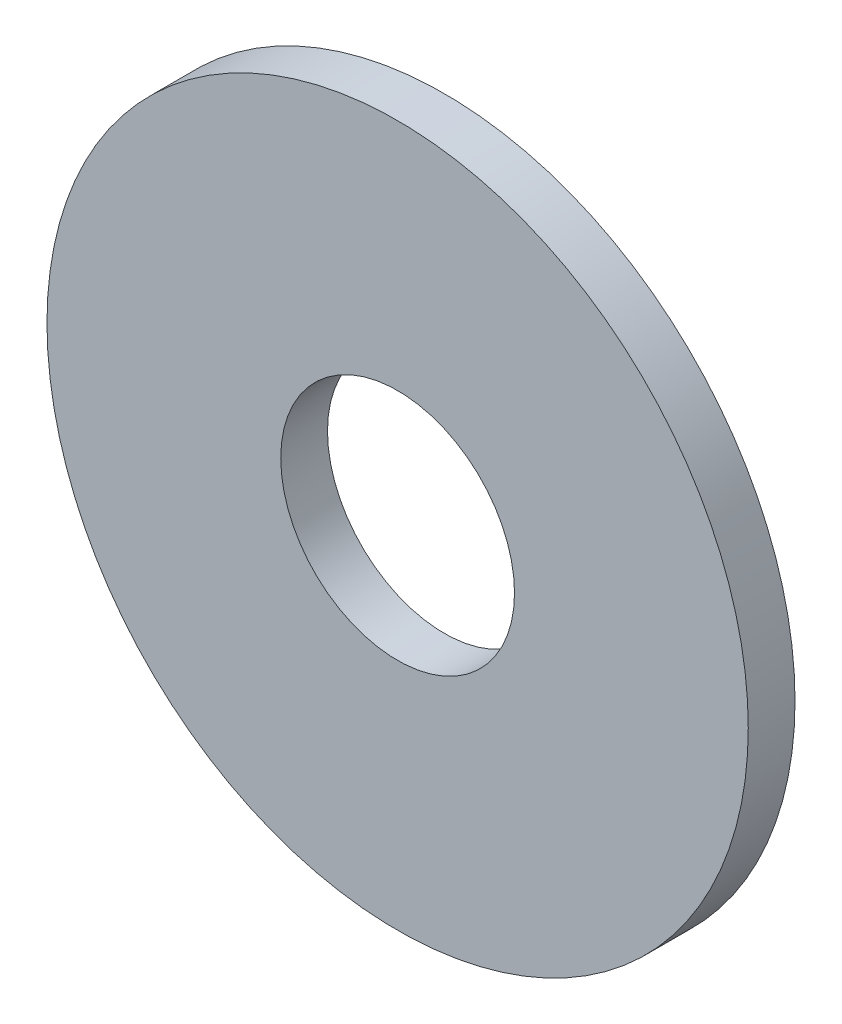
from build123d import *

# Parameters (mm, degrees)
CROQUIS1_R              = 15
CROQUIS1_R_2            = 5
SALIENTE_EXTRUIR1_DEPTH = 2


with BuildPart() as part:
    # Croquis1 → Saliente-Extruir1 (new body)
    with BuildSketch(Plane.XY):
        Circle(CROQUIS1_R)
        Circle(CROQUIS1_R_2, mode=Mode.SUBTRACT)
    extrude(amount=SALIENTE_EXTRUIR1_DEPTH)


solid = part.part
